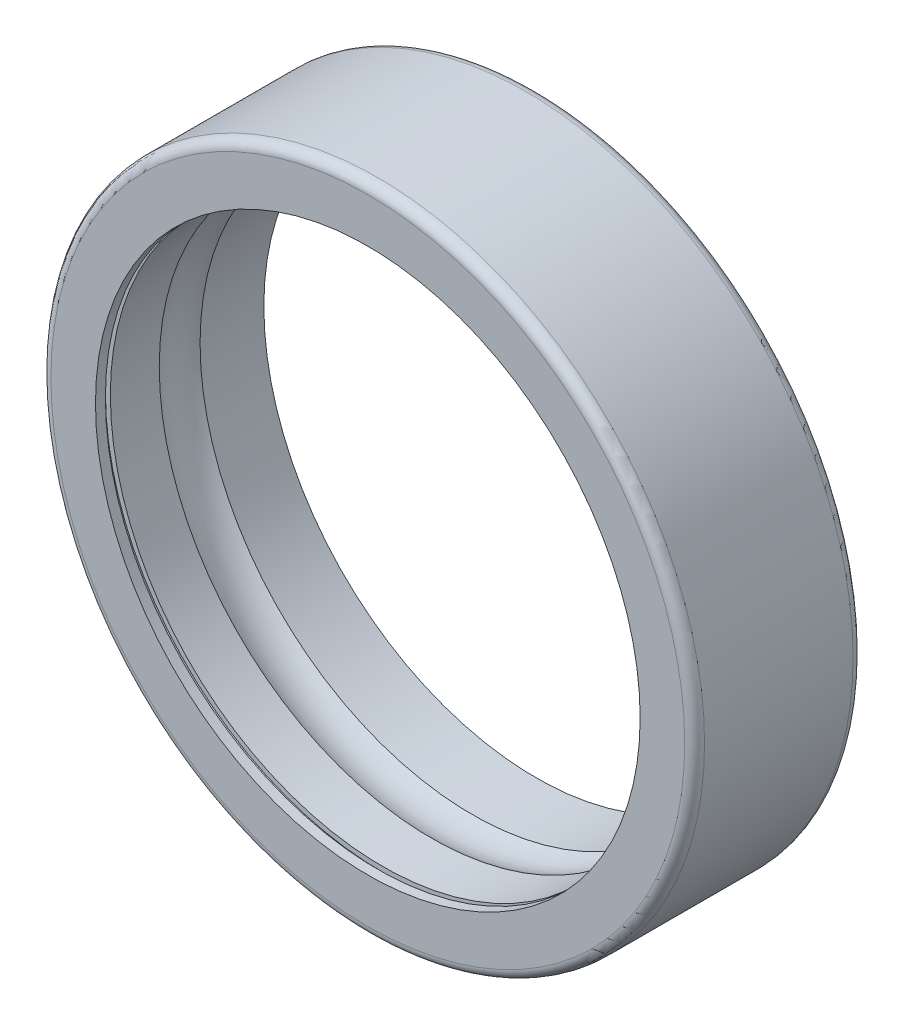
from build123d import *


with BuildPart() as part:
    # Esquisse1 → Base-R_volution (revolve)
    with BuildSketch(Plane(origin=(0, 0, 0), x_dir=(0, 0, -1), z_dir=(1, 0, 0)), mode=Mode.PRIVATE) as base_r_volution_sk:
        with BuildLine():
            Line((-3.75, 16.5), (3.75, 16.5))
            ThreePointArc((3.75, 16.5), (4.103553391, 16.353553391), (4.25, 16))
            Line((4.25, 16), (4.25, 13.75))
            Line((4.25, 13.75), (1.030776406, 13.75))
            ThreePointArc((1.030776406, 13.75), (0, 14), (-1.030776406, 13.75))
            Line((-1.030776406, 13.75), (-3.5, 13.75))
            Line((-3.5, 13.75), (-3.5, 14))
            Line((-3.5, 14), (-3.75, 14))
            Line((-3.75, 14), (-3.75, 13.75))
            Line((-3.75, 13.75), (-4.25, 13.75))
            Line((-4.25, 13.75), (-4.25, 16))
            ThreePointArc((-4.25, 16), (-4.103553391, 16.353553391), (-3.75, 16.5))
        make_face()
    revolve(base_r_volution_sk.sketch.rotate(Axis((0, 0, 0), (0, 0, 1)), 90), axis=Axis((0, 0, 0), (0, 0, 1)))


solid = part.part
